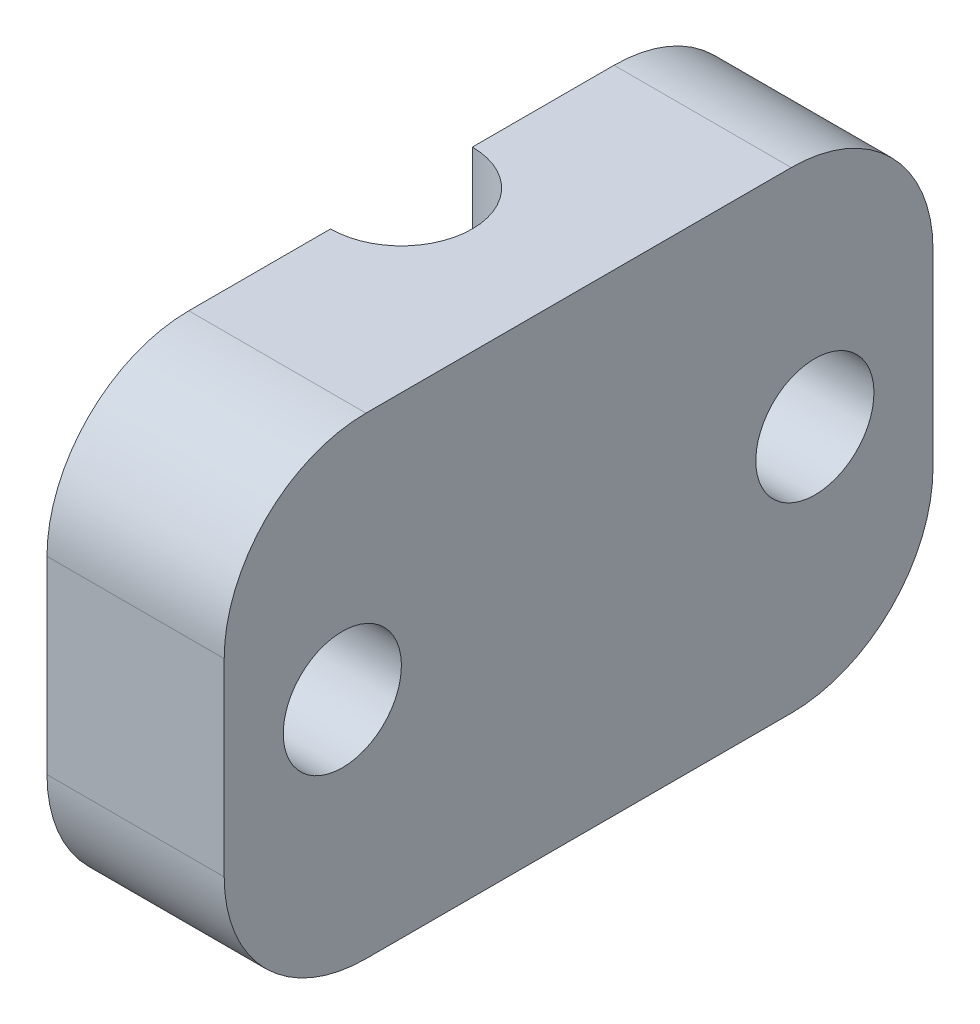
from build123d import *

# Parameters (mm, degrees)
SKETCH3_W           = 15
SKETCH3_H           = 20
BOSS_EXTRUDE1_DEPTH = 30
SKETCH4_R           = 3
CUT_EXTRUDE1_DEPTH  = 10
SKETCH5_R           = 4
CUT_EXTRUDE2_DEPTH  = 12
FILLET1_R           = 6
SKETCH9_W           = 39.528506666
SKETCH9_H           = 52.074932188
CUT_EXTRUDE4_DEPTH  = 7.5
SKETCH10_R          = 2.5
CUT_EXTRUDE5_DEPTH  = 37.827299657


with BuildPart() as part:
    # Sketch3 → Boss-Extrude1 (new body)
    with BuildSketch(Plane.XY):
        with Locations((-7.5, 10)):
            Rectangle(SKETCH3_W, SKETCH3_H)
    extrude(amount=BOSS_EXTRUDE1_DEPTH)

    # Sketch4 → Cut-Extrude1 (cut)
    with BuildSketch(Plane(origin=(0, 20, 0), x_dir=(1, 0, 0), z_dir=(0, 1, 0))):
        with Locations((-7.5, -15)):
            Circle(SKETCH4_R)
    extrude(amount=-CUT_EXTRUDE1_DEPTH, mode=Mode.SUBTRACT)

    # Sketch5 → Cut-Extrude2 (cut)
    with BuildSketch(Plane.XZ):
        with Locations((-7.5, 15)):
            Circle(SKETCH5_R)
    extrude(amount=-CUT_EXTRUDE2_DEPTH, mode=Mode.SUBTRACT)

    # Fillet1
    fillet1_edges = [part.edges().sort_by_distance(p)[0] for p in [
        (-7.5, 0, 30),
        (-7.5, 0, 0),
        (-7.5, 20, 0),
        (-7.5, 20, 30),
    ]]
    fillet(fillet1_edges, radius=FILLET1_R)

    # Sketch9 → Cut-Extrude4 (cut)
    with BuildSketch(Plane.ZY.offset(15)):
        with Locations((16.01739888, 20.55708067)):
            Rectangle(SKETCH9_W, SKETCH9_H)
    extrude(amount=-CUT_EXTRUDE4_DEPTH, mode=Mode.SUBTRACT)

    # Sketch10 → Cut-Extrude5 (cut, through all)
    with BuildSketch(Plane.ZY.offset(7.5)):
        with Locations(Location((25, 10, 0), (0, 0, 270))):
            Circle(SKETCH10_R)
        with Locations(Location((5, 10, 0), (0, 0, 270))):
            Circle(SKETCH10_R)
    extrude(amount=-CUT_EXTRUDE5_DEPTH, mode=Mode.SUBTRACT)


solid = part.part
